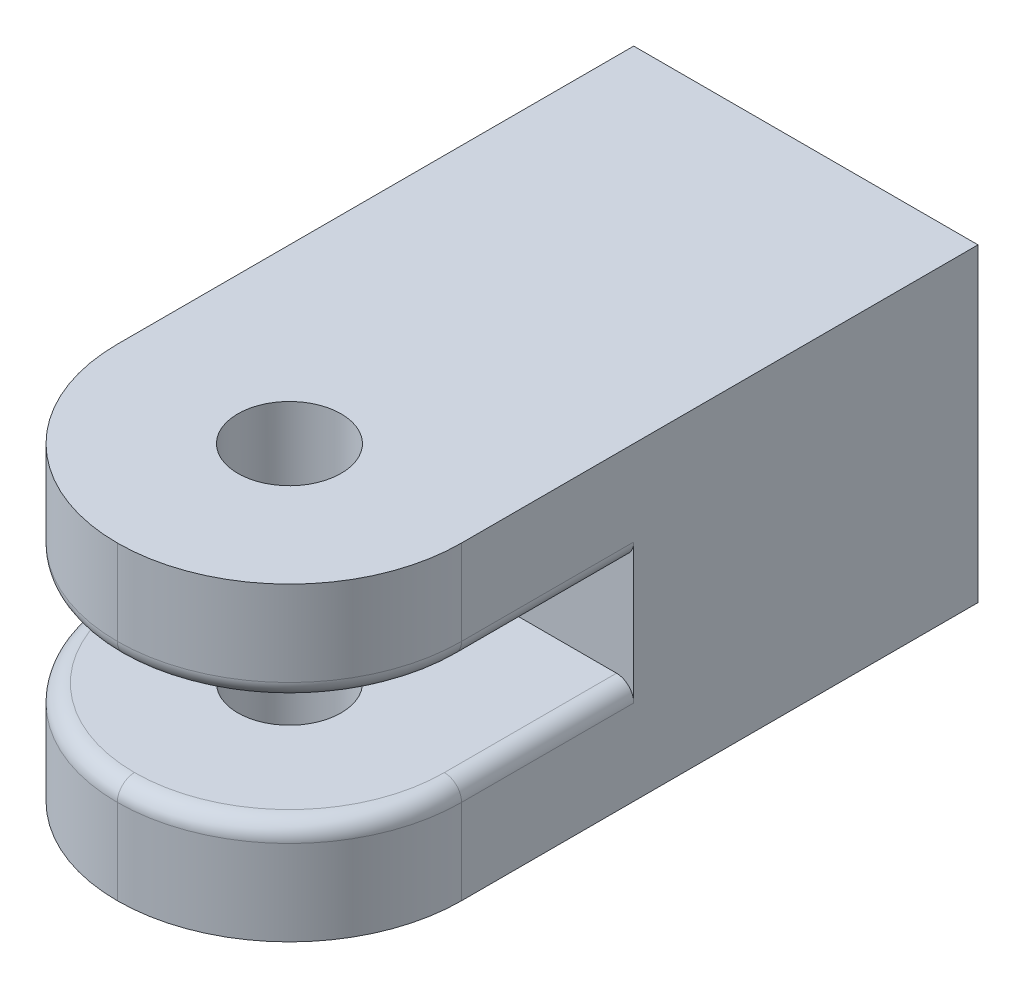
ISO-10303-21;
HEADER;
FILE_DESCRIPTION(('STEP AP214'),'2;1');
FILE_NAME('part.step','',(''),(''),'','','');
FILE_SCHEMA(('AUTOMOTIVE_DESIGN { 1 0 10303 214 1 1 1 1 }'));
ENDSEC;
DATA;
#1=APPLICATION_CONTEXT('core data for automotive mechanical design processes');
#2=APPLICATION_PROTOCOL_DEFINITION('international standard','automotive_design',2000,#1);
#3=PRODUCT_CONTEXT('',#1,'mechanical');
#4=PRODUCT('Part','Part','',(#3));
#5=PRODUCT_RELATED_PRODUCT_CATEGORY('part','',(#4));
#6=PRODUCT_DEFINITION_FORMATION('','',#4);
#7=PRODUCT_DEFINITION_CONTEXT('part definition',#1,'design');
#8=PRODUCT_DEFINITION('design','',#6,#7);
#9=PRODUCT_DEFINITION_SHAPE('','',#8);
#10=(LENGTH_UNIT() NAMED_UNIT(*) SI_UNIT(.MILLI.,.METRE.));
#11=(NAMED_UNIT(*) PLANE_ANGLE_UNIT() SI_UNIT($,.RADIAN.));
#12=(NAMED_UNIT(*) SI_UNIT($,.STERADIAN.) SOLID_ANGLE_UNIT());
#13=UNCERTAINTY_MEASURE_WITH_UNIT(LENGTH_MEASURE(1.E-05),#10,'distance_accuracy_value','');
#14=(GEOMETRIC_REPRESENTATION_CONTEXT(3) GLOBAL_UNCERTAINTY_ASSIGNED_CONTEXT((#13)) GLOBAL_UNIT_ASSIGNED_CONTEXT((#10,
#11,#12)) REPRESENTATION_CONTEXT('',''));
#15=CARTESIAN_POINT('',(0.,0.,0.));
#16=DIRECTION('',(0.,0.,1.));
#17=DIRECTION('',(1.,0.,0.));
#18=AXIS2_PLACEMENT_3D('',#15,#16,#17);
#19=CARTESIAN_POINT('',(0.,0.,20.));
#20=DIRECTION('',(1.,0.,0.));
#21=DIRECTION('',(0.,0.,-1.));
#22=AXIS2_PLACEMENT_3D('',#19,#20,#21);
#23=PLANE('',#22);
#24=DIRECTION('',(0.,-1.,0.));
#25=VECTOR('',#24,1.);
#26=CARTESIAN_POINT('',(0.,2.975,10.));
#27=LINE('',#26,#25);
#28=CARTESIAN_POINT('',(0.,6.525,10.));
#29=VERTEX_POINT('',#28);
#30=CARTESIAN_POINT('',(0.,2.475,10.));
#31=VERTEX_POINT('',#30);
#32=EDGE_CURVE('E185',#29,#31,#27,.T.);
#33=ORIENTED_EDGE('',*,*,#32,.F.);
#34=DIRECTION('',(0.,0.,1.));
#35=VECTOR('',#34,1.);
#36=CARTESIAN_POINT('',(0.,6.525,20.));
#37=LINE('',#36,#35);
#38=CARTESIAN_POINT('',(0.,6.525,15.));
#39=VERTEX_POINT('',#38);
#40=EDGE_CURVE('E242',#29,#39,#37,.T.);
#41=ORIENTED_EDGE('',*,*,#40,.T.);
#42=DIRECTION('',(0.,-1.,0.));
#43=VECTOR('',#42,1.);
#44=CARTESIAN_POINT('',(0.,0.,15.));
#45=LINE('',#44,#43);
#46=CARTESIAN_POINT('',(0.,9.,15.));
#47=VERTEX_POINT('',#46);
#48=EDGE_CURVE('E227',#39,#47,#45,.F.);
#49=ORIENTED_EDGE('',*,*,#48,.T.);
#50=DIRECTION('',(0.,0.,-1.));
#51=VECTOR('',#50,1.);
#52=CARTESIAN_POINT('',(0.,9.,20.));
#53=LINE('',#52,#51);
#54=CARTESIAN_POINT('',(0.,9.,0.));
#55=VERTEX_POINT('',#54);
#56=EDGE_CURVE('E178',#47,#55,#53,.T.);
#57=ORIENTED_EDGE('',*,*,#56,.T.);
#58=DIRECTION('',(0.,-1.,0.));
#59=VECTOR('',#58,1.);
#60=CARTESIAN_POINT('',(0.,0.,0.));
#61=LINE('',#60,#59);
#62=CARTESIAN_POINT('',(0.,0.,0.));
#63=VERTEX_POINT('',#62);
#64=EDGE_CURVE('E172',#55,#63,#61,.T.);
#65=ORIENTED_EDGE('',*,*,#64,.T.);
#66=DIRECTION('',(0.,0.,-1.));
#67=VECTOR('',#66,1.);
#68=CARTESIAN_POINT('',(0.,0.,20.));
#69=LINE('',#68,#67);
#70=CARTESIAN_POINT('',(0.,0.,15.));
#71=VERTEX_POINT('',#70);
#72=EDGE_CURVE('E151',#71,#63,#69,.T.);
#73=ORIENTED_EDGE('',*,*,#72,.F.);
#74=DIRECTION('',(0.,-1.,0.));
#75=VECTOR('',#74,1.);
#76=CARTESIAN_POINT('',(0.,0.,15.));
#77=LINE('',#76,#75);
#78=CARTESIAN_POINT('',(0.,2.475,15.));
#79=VERTEX_POINT('',#78);
#80=EDGE_CURVE('E224',#71,#79,#77,.F.);
#81=ORIENTED_EDGE('',*,*,#80,.T.);
#82=DIRECTION('',(0.,0.,1.));
#83=VECTOR('',#82,1.);
#84=CARTESIAN_POINT('',(0.,2.475,20.));
#85=LINE('',#84,#83);
#86=EDGE_CURVE('E230',#79,#31,#85,.F.);
#87=ORIENTED_EDGE('',*,*,#86,.T.);
#88=EDGE_LOOP('',(#33,#41,#49,#57,#65,#73,#81,#87));
#89=FACE_BOUND('',#88,.T.);
#90=ADVANCED_FACE('F45',(#89),#23,.F.);
#91=CARTESIAN_POINT('',(0.,0.,20.));
#92=DIRECTION('',(0.,1.,0.));
#93=DIRECTION('',(0.,0.,1.));
#94=AXIS2_PLACEMENT_3D('',#91,#92,#93);
#95=PLANE('',#94);
#96=CARTESIAN_POINT('',(5.,0.,15.));
#97=DIRECTION('',(0.,-1.,0.));
#98=DIRECTION('',(0.,0.,-1.));
#99=AXIS2_PLACEMENT_3D('',#96,#97,#98);
#100=CIRCLE('',#99,1.5);
#101=CARTESIAN_POINT('',(5.,0.,13.5));
#102=VERTEX_POINT('',#101);
#103=EDGE_CURVE('E206',#102,#102,#100,.T.);
#104=ORIENTED_EDGE('',*,*,#103,.F.);
#105=EDGE_LOOP('',(#104));
#106=FACE_BOUND('',#105,.T.);
#107=DIRECTION('',(0.,0.,-1.));
#108=VECTOR('',#107,1.);
#109=CARTESIAN_POINT('',(10.,0.,20.));
#110=LINE('',#109,#108);
#111=CARTESIAN_POINT('',(10.,0.,15.));
#112=VERTEX_POINT('',#111);
#113=CARTESIAN_POINT('',(10.,0.,0.));
#114=VERTEX_POINT('',#113);
#115=EDGE_CURVE('E166',#112,#114,#110,.T.);
#116=ORIENTED_EDGE('',*,*,#115,.F.);
#117=CARTESIAN_POINT('',(5.,0.,15.));
#118=DIRECTION('',(0.,1.,0.));
#119=DIRECTION('',(0.,0.,1.));
#120=AXIS2_PLACEMENT_3D('',#117,#118,#119);
#121=CIRCLE('',#120,5.);
#122=CARTESIAN_POINT('',(5.,0.,20.));
#123=VERTEX_POINT('',#122);
#124=EDGE_CURVE('E215',#112,#123,#121,.F.);
#125=ORIENTED_EDGE('',*,*,#124,.T.);
#126=CARTESIAN_POINT('',(5.,0.,15.));
#127=DIRECTION('',(0.,1.,0.));
#128=DIRECTION('',(0.,0.,1.));
#129=AXIS2_PLACEMENT_3D('',#126,#127,#128);
#130=CIRCLE('',#129,5.);
#131=EDGE_CURVE('E159',#123,#71,#130,.F.);
#132=ORIENTED_EDGE('',*,*,#131,.T.);
#133=ORIENTED_EDGE('',*,*,#72,.T.);
#134=DIRECTION('',(1.,0.,0.));
#135=VECTOR('',#134,1.);
#136=CARTESIAN_POINT('',(0.,0.,0.));
#137=LINE('',#136,#135);
#138=EDGE_CURVE('E155',#63,#114,#137,.T.);
#139=ORIENTED_EDGE('',*,*,#138,.T.);
#140=EDGE_LOOP('',(#116,#125,#132,#133,#139));
#141=FACE_BOUND('',#140,.T.);
#142=ADVANCED_FACE('F154',(#106,#141),#95,.F.);
#143=CARTESIAN_POINT('',(10.,0.,20.));
#144=DIRECTION('',(-1.,0.,0.));
#145=DIRECTION('',(0.,0.,1.));
#146=AXIS2_PLACEMENT_3D('',#143,#144,#145);
#147=PLANE('',#146);
#148=DIRECTION('',(0.,1.,0.));
#149=VECTOR('',#148,1.);
#150=CARTESIAN_POINT('',(10.,0.,15.));
#151=LINE('',#150,#149);
#152=CARTESIAN_POINT('',(10.,9.,15.));
#153=VERTEX_POINT('',#152);
#154=CARTESIAN_POINT('',(10.,6.525,15.));
#155=VERTEX_POINT('',#154);
#156=EDGE_CURVE('E165',#153,#155,#151,.F.);
#157=ORIENTED_EDGE('',*,*,#156,.T.);
#158=DIRECTION('',(0.,0.,1.));
#159=VECTOR('',#158,1.);
#160=CARTESIAN_POINT('',(10.,6.525,20.));
#161=LINE('',#160,#159);
#162=CARTESIAN_POINT('',(10.,6.525,10.));
#163=VERTEX_POINT('',#162);
#164=EDGE_CURVE('E286',#155,#163,#161,.F.);
#165=ORIENTED_EDGE('',*,*,#164,.T.);
#166=DIRECTION('',(0.,1.,0.));
#167=VECTOR('',#166,1.);
#168=CARTESIAN_POINT('',(10.,2.975,10.));
#169=LINE('',#168,#167);
#170=CARTESIAN_POINT('',(10.,2.475,10.));
#171=VERTEX_POINT('',#170);
#172=EDGE_CURVE('E62',#171,#163,#169,.T.);
#173=ORIENTED_EDGE('',*,*,#172,.F.);
#174=DIRECTION('',(0.,0.,1.));
#175=VECTOR('',#174,1.);
#176=CARTESIAN_POINT('',(10.,2.475,20.));
#177=LINE('',#176,#175);
#178=CARTESIAN_POINT('',(10.,2.475,15.));
#179=VERTEX_POINT('',#178);
#180=EDGE_CURVE('E283',#171,#179,#177,.T.);
#181=ORIENTED_EDGE('',*,*,#180,.T.);
#182=DIRECTION('',(0.,1.,0.));
#183=VECTOR('',#182,1.);
#184=CARTESIAN_POINT('',(10.,0.,15.));
#185=LINE('',#184,#183);
#186=EDGE_CURVE('E210',#179,#112,#185,.F.);
#187=ORIENTED_EDGE('',*,*,#186,.T.);
#188=ORIENTED_EDGE('',*,*,#115,.T.);
#189=DIRECTION('',(0.,1.,0.));
#190=VECTOR('',#189,1.);
#191=CARTESIAN_POINT('',(10.,0.,0.));
#192=LINE('',#191,#190);
#193=CARTESIAN_POINT('',(10.,9.,0.));
#194=VERTEX_POINT('',#193);
#195=EDGE_CURVE('E174',#114,#194,#192,.T.);
#196=ORIENTED_EDGE('',*,*,#195,.T.);
#197=DIRECTION('',(0.,0.,-1.));
#198=VECTOR('',#197,1.);
#199=CARTESIAN_POINT('',(10.,9.,20.));
#200=LINE('',#199,#198);
#201=EDGE_CURVE('E196',#153,#194,#200,.T.);
#202=ORIENTED_EDGE('',*,*,#201,.F.);
#203=EDGE_LOOP('',(#157,#165,#173,#181,#187,#188,#196,#202));
#204=FACE_BOUND('',#203,.T.);
#205=ADVANCED_FACE('F376',(#204),#147,.F.);
#206=CARTESIAN_POINT('',(0.,9.,20.));
#207=DIRECTION('',(0.,-1.,0.));
#208=DIRECTION('',(0.,0.,-1.));
#209=AXIS2_PLACEMENT_3D('',#206,#207,#208);
#210=PLANE('',#209);
#211=CARTESIAN_POINT('',(5.,9.,15.));
#212=DIRECTION('',(0.,-1.,0.));
#213=DIRECTION('',(0.,0.,-1.));
#214=AXIS2_PLACEMENT_3D('',#211,#212,#213);
#215=CIRCLE('',#214,1.5);
#216=CARTESIAN_POINT('',(5.,9.,13.5));
#217=VERTEX_POINT('',#216);
#218=EDGE_CURVE('E566',#217,#217,#215,.T.);
#219=ORIENTED_EDGE('',*,*,#218,.T.);
#220=EDGE_LOOP('',(#219));
#221=FACE_BOUND('',#220,.T.);
#222=CARTESIAN_POINT('',(5.,9.,15.));
#223=DIRECTION('',(0.,-1.,0.));
#224=DIRECTION('',(0.,0.,-1.));
#225=AXIS2_PLACEMENT_3D('',#222,#223,#224);
#226=CIRCLE('',#225,5.);
#227=CARTESIAN_POINT('',(5.,9.,20.));
#228=VERTEX_POINT('',#227);
#229=EDGE_CURVE('E218',#47,#228,#226,.F.);
#230=ORIENTED_EDGE('',*,*,#229,.T.);
#231=CARTESIAN_POINT('',(5.,9.,15.));
#232=DIRECTION('',(0.,-1.,0.));
#233=DIRECTION('',(0.,0.,-1.));
#234=AXIS2_PLACEMENT_3D('',#231,#232,#233);
#235=CIRCLE('',#234,5.);
#236=EDGE_CURVE('E221',#228,#153,#235,.F.);
#237=ORIENTED_EDGE('',*,*,#236,.T.);
#238=ORIENTED_EDGE('',*,*,#201,.T.);
#239=DIRECTION('',(-1.,0.,0.));
#240=VECTOR('',#239,1.);
#241=CARTESIAN_POINT('',(0.,9.,0.));
#242=LINE('',#241,#240);
#243=EDGE_CURVE('E191',#194,#55,#242,.T.);
#244=ORIENTED_EDGE('',*,*,#243,.T.);
#245=ORIENTED_EDGE('',*,*,#56,.F.);
#246=EDGE_LOOP('',(#230,#237,#238,#244,#245));
#247=FACE_BOUND('',#246,.T.);
#248=ADVANCED_FACE('F379',(#221,#247),#210,.F.);
#249=CARTESIAN_POINT('',(0.,0.,0.));
#250=DIRECTION('',(0.,0.,-1.));
#251=DIRECTION('',(-1.,0.,0.));
#252=AXIS2_PLACEMENT_3D('',#249,#250,#251);
#253=PLANE('',#252);
#254=ORIENTED_EDGE('',*,*,#64,.F.);
#255=ORIENTED_EDGE('',*,*,#243,.F.);
#256=ORIENTED_EDGE('',*,*,#195,.F.);
#257=ORIENTED_EDGE('',*,*,#138,.F.);
#258=EDGE_LOOP('',(#254,#255,#256,#257));
#259=FACE_BOUND('',#258,.T.);
#260=ADVANCED_FACE('F170',(#259),#253,.T.);
#261=CARTESIAN_POINT('',(0.,2.975,10.));
#262=DIRECTION('',(0.,-1.,0.));
#263=DIRECTION('',(1.,0.,0.));
#264=AXIS2_PLACEMENT_3D('',#261,#262,#263);
#265=PLANE('',#264);
#266=CARTESIAN_POINT('',(5.,2.975,15.));
#267=DIRECTION('',(0.,-1.,0.));
#268=DIRECTION('',(1.,0.,0.));
#269=AXIS2_PLACEMENT_3D('',#266,#267,#268);
#270=CIRCLE('',#269,1.5);
#271=CARTESIAN_POINT('',(6.5,2.975,15.));
#272=VERTEX_POINT('',#271);
#273=EDGE_CURVE('E205',#272,#272,#270,.T.);
#274=ORIENTED_EDGE('',*,*,#273,.T.);
#275=EDGE_LOOP('',(#274));
#276=FACE_BOUND('',#275,.T.);
#277=DIRECTION('',(1.,0.,0.));
#278=VECTOR('',#277,1.);
#279=CARTESIAN_POINT('',(0.,2.975,10.));
#280=LINE('',#279,#278);
#281=CARTESIAN_POINT('',(0.5,2.975,10.));
#282=VERTEX_POINT('',#281);
#283=CARTESIAN_POINT('',(9.5,2.975,10.));
#284=VERTEX_POINT('',#283);
#285=EDGE_CURVE('E181',#282,#284,#280,.T.);
#286=ORIENTED_EDGE('',*,*,#285,.F.);
#287=DIRECTION('',(0.,0.,1.));
#288=VECTOR('',#287,1.);
#289=CARTESIAN_POINT('',(0.5,2.975,10.));
#290=LINE('',#289,#288);
#291=CARTESIAN_POINT('',(0.5,2.975,15.));
#292=VERTEX_POINT('',#291);
#293=EDGE_CURVE('E273',#282,#292,#290,.T.);
#294=ORIENTED_EDGE('',*,*,#293,.T.);
#295=CARTESIAN_POINT('',(5.,2.975,15.));
#296=DIRECTION('',(0.,-1.,0.));
#297=DIRECTION('',(1.,0.,0.));
#298=AXIS2_PLACEMENT_3D('',#295,#296,#297);
#299=CIRCLE('',#298,4.5);
#300=CARTESIAN_POINT('',(5.,2.975,19.5));
#301=VERTEX_POINT('',#300);
#302=EDGE_CURVE('E270',#292,#301,#299,.F.);
#303=ORIENTED_EDGE('',*,*,#302,.T.);
#304=CARTESIAN_POINT('',(5.,2.975,15.));
#305=DIRECTION('',(0.,-1.,0.));
#306=DIRECTION('',(1.,0.,0.));
#307=AXIS2_PLACEMENT_3D('',#304,#305,#306);
#308=CIRCLE('',#307,4.5);
#309=CARTESIAN_POINT('',(9.5,2.975,15.));
#310=VERTEX_POINT('',#309);
#311=EDGE_CURVE('E267',#301,#310,#308,.F.);
#312=ORIENTED_EDGE('',*,*,#311,.T.);
#313=DIRECTION('',(0.,0.,1.));
#314=VECTOR('',#313,1.);
#315=CARTESIAN_POINT('',(9.5,2.975,10.));
#316=LINE('',#315,#314);
#317=EDGE_CURVE('E264',#310,#284,#316,.F.);
#318=ORIENTED_EDGE('',*,*,#317,.T.);
#319=EDGE_LOOP('',(#286,#294,#303,#312,#318));
#320=FACE_BOUND('',#319,.T.);
#321=ADVANCED_FACE('F330',(#276,#320),#265,.F.);
#322=CARTESIAN_POINT('',(0.,6.025,10.));
#323=DIRECTION('',(0.,1.,0.));
#324=DIRECTION('',(0.,0.,1.));
#325=AXIS2_PLACEMENT_3D('',#322,#323,#324);
#326=PLANE('',#325);
#327=CARTESIAN_POINT('',(5.,6.025,15.));
#328=DIRECTION('',(0.,1.,0.));
#329=DIRECTION('',(0.,0.,1.));
#330=AXIS2_PLACEMENT_3D('',#327,#328,#329);
#331=CIRCLE('',#330,1.5);
#332=CARTESIAN_POINT('',(5.,6.025,16.5));
#333=VERTEX_POINT('',#332);
#334=EDGE_CURVE('E201',#333,#333,#331,.T.);
#335=ORIENTED_EDGE('',*,*,#334,.T.);
#336=EDGE_LOOP('',(#335));
#337=FACE_BOUND('',#336,.T.);
#338=CARTESIAN_POINT('',(5.,6.025,15.));
#339=DIRECTION('',(0.,1.,0.));
#340=DIRECTION('',(0.,0.,1.));
#341=AXIS2_PLACEMENT_3D('',#338,#339,#340);
#342=CIRCLE('',#341,4.5);
#343=CARTESIAN_POINT('',(5.,6.025,19.5));
#344=VERTEX_POINT('',#343);
#345=CARTESIAN_POINT('',(0.5,6.025,15.));
#346=VERTEX_POINT('',#345);
#347=EDGE_CURVE('E252',#344,#346,#342,.F.);
#348=ORIENTED_EDGE('',*,*,#347,.T.);
#349=DIRECTION('',(0.,0.,1.));
#350=VECTOR('',#349,1.);
#351=CARTESIAN_POINT('',(0.5,6.025,10.));
#352=LINE('',#351,#350);
#353=CARTESIAN_POINT('',(0.5,6.025,10.));
#354=VERTEX_POINT('',#353);
#355=EDGE_CURVE('E255',#346,#354,#352,.F.);
#356=ORIENTED_EDGE('',*,*,#355,.T.);
#357=DIRECTION('',(-1.,0.,0.));
#358=VECTOR('',#357,1.);
#359=CARTESIAN_POINT('',(0.,6.025,10.));
#360=LINE('',#359,#358);
#361=CARTESIAN_POINT('',(9.5,6.025,10.));
#362=VERTEX_POINT('',#361);
#363=EDGE_CURVE('E345',#362,#354,#360,.T.);
#364=ORIENTED_EDGE('',*,*,#363,.F.);
#365=DIRECTION('',(0.,0.,1.));
#366=VECTOR('',#365,1.);
#367=CARTESIAN_POINT('',(9.5,6.025,10.));
#368=LINE('',#367,#366);
#369=CARTESIAN_POINT('',(9.5,6.025,15.));
#370=VERTEX_POINT('',#369);
#371=EDGE_CURVE('E246',#362,#370,#368,.T.);
#372=ORIENTED_EDGE('',*,*,#371,.T.);
#373=CARTESIAN_POINT('',(5.,6.025,15.));
#374=DIRECTION('',(0.,1.,0.));
#375=DIRECTION('',(0.,0.,1.));
#376=AXIS2_PLACEMENT_3D('',#373,#374,#375);
#377=CIRCLE('',#376,4.5);
#378=EDGE_CURVE('E249',#370,#344,#377,.F.);
#379=ORIENTED_EDGE('',*,*,#378,.T.);
#380=EDGE_LOOP('',(#348,#356,#364,#372,#379));
#381=FACE_BOUND('',#380,.T.);
#382=ADVANCED_FACE('F475',(#337,#381),#326,.F.);
#383=CARTESIAN_POINT('',(0.,0.,10.));
#384=DIRECTION('',(0.,0.,-1.));
#385=DIRECTION('',(-1.,0.,0.));
#386=AXIS2_PLACEMENT_3D('',#383,#384,#385);
#387=PLANE('',#386);
#388=ORIENTED_EDGE('',*,*,#172,.T.);
#389=CARTESIAN_POINT('',(9.5,6.525,10.));
#390=DIRECTION('',(0.,0.,-1.));
#391=DIRECTION('',(-1.,0.,0.));
#392=AXIS2_PLACEMENT_3D('',#389,#390,#391);
#393=CIRCLE('',#392,0.5);
#394=EDGE_CURVE('E55',#163,#362,#393,.T.);
#395=ORIENTED_EDGE('',*,*,#394,.T.);
#396=ORIENTED_EDGE('',*,*,#363,.T.);
#397=CARTESIAN_POINT('',(0.5,6.525,10.));
#398=DIRECTION('',(0.,0.,-1.));
#399=DIRECTION('',(-1.,0.,0.));
#400=AXIS2_PLACEMENT_3D('',#397,#398,#399);
#401=CIRCLE('',#400,0.5);
#402=EDGE_CURVE('E289',#354,#29,#401,.T.);
#403=ORIENTED_EDGE('',*,*,#402,.T.);
#404=ORIENTED_EDGE('',*,*,#32,.T.);
#405=CARTESIAN_POINT('',(0.5,2.475,10.));
#406=DIRECTION('',(0.,0.,-1.));
#407=DIRECTION('',(-1.,0.,0.));
#408=AXIS2_PLACEMENT_3D('',#405,#406,#407);
#409=CIRCLE('',#408,0.5);
#410=EDGE_CURVE('E293',#31,#282,#409,.T.);
#411=ORIENTED_EDGE('',*,*,#410,.T.);
#412=ORIENTED_EDGE('',*,*,#285,.T.);
#413=CARTESIAN_POINT('',(9.5,2.475,10.));
#414=DIRECTION('',(0.,0.,-1.));
#415=DIRECTION('',(-1.,0.,0.));
#416=AXIS2_PLACEMENT_3D('',#413,#414,#415);
#417=CIRCLE('',#416,0.5);
#418=EDGE_CURVE('E11',#284,#171,#417,.T.);
#419=ORIENTED_EDGE('',*,*,#418,.T.);
#420=EDGE_LOOP('',(#388,#395,#396,#403,#404,#411,#412,#419));
#421=FACE_BOUND('',#420,.T.);
#422=ADVANCED_FACE('F332',(#421),#387,.F.);
#423=CARTESIAN_POINT('',(5.,10.,15.));
#424=DIRECTION('',(0.,-1.,0.));
#425=DIRECTION('',(0.,0.,-1.));
#426=AXIS2_PLACEMENT_3D('',#423,#424,#425);
#427=CYLINDRICAL_SURFACE('',#426,1.5);
#428=ORIENTED_EDGE('',*,*,#334,.F.);
#429=EDGE_LOOP('',(#428));
#430=FACE_BOUND('',#429,.T.);
#431=ORIENTED_EDGE('',*,*,#218,.F.);
#432=EDGE_LOOP('',(#431));
#433=FACE_BOUND('',#432,.T.);
#434=ADVANCED_FACE('F474',(#430,#433),#427,.F.);
#435=ORIENTED_EDGE('',*,*,#103,.T.);
#436=EDGE_LOOP('',(#435));
#437=FACE_BOUND('',#436,.T.);
#438=ORIENTED_EDGE('',*,*,#273,.F.);
#439=EDGE_LOOP('',(#438));
#440=FACE_BOUND('',#439,.T.);
#441=ADVANCED_FACE('F404',(#437,#440),#427,.F.);
#442=CARTESIAN_POINT('',(5.,0.,15.));
#443=DIRECTION('',(0.,-1.,0.));
#444=DIRECTION('',(0.,0.,-1.));
#445=AXIS2_PLACEMENT_3D('',#442,#443,#444);
#446=CYLINDRICAL_SURFACE('',#445,5.);
#447=DIRECTION('',(0.,-1.,0.));
#448=VECTOR('',#447,1.);
#449=CARTESIAN_POINT('',(5.,0.,20.));
#450=LINE('',#449,#448);
#451=CARTESIAN_POINT('',(5.,2.475,20.));
#452=VERTEX_POINT('',#451);
#453=EDGE_CURVE('E231',#452,#123,#450,.T.);
#454=ORIENTED_EDGE('',*,*,#453,.F.);
#455=CARTESIAN_POINT('',(5.,2.475,15.));
#456=DIRECTION('',(0.,-1.,0.));
#457=DIRECTION('',(1.,0.,0.));
#458=AXIS2_PLACEMENT_3D('',#455,#456,#457);
#459=CIRCLE('',#458,5.);
#460=EDGE_CURVE('E277',#452,#79,#459,.T.);
#461=ORIENTED_EDGE('',*,*,#460,.T.);
#462=ORIENTED_EDGE('',*,*,#80,.F.);
#463=ORIENTED_EDGE('',*,*,#131,.F.);
#464=EDGE_LOOP('',(#454,#461,#462,#463));
#465=FACE_BOUND('',#464,.T.);
#466=ADVANCED_FACE('F341',(#465),#446,.T.);
#467=CARTESIAN_POINT('',(5.,0.,15.));
#468=DIRECTION('',(0.,1.,0.));
#469=DIRECTION('',(0.,0.,1.));
#470=AXIS2_PLACEMENT_3D('',#467,#468,#469);
#471=CYLINDRICAL_SURFACE('',#470,5.);
#472=ORIENTED_EDGE('',*,*,#186,.F.);
#473=CARTESIAN_POINT('',(5.,2.475,15.));
#474=DIRECTION('',(0.,-1.,0.));
#475=DIRECTION('',(1.,0.,0.));
#476=AXIS2_PLACEMENT_3D('',#473,#474,#475);
#477=CIRCLE('',#476,5.);
#478=EDGE_CURVE('E280',#179,#452,#477,.T.);
#479=ORIENTED_EDGE('',*,*,#478,.T.);
#480=ORIENTED_EDGE('',*,*,#453,.T.);
#481=ORIENTED_EDGE('',*,*,#124,.F.);
#482=EDGE_LOOP('',(#472,#479,#480,#481));
#483=FACE_BOUND('',#482,.T.);
#484=ADVANCED_FACE('F398',(#483),#471,.T.);
#485=CARTESIAN_POINT('',(5.,0.,15.));
#486=DIRECTION('',(0.,-1.,0.));
#487=DIRECTION('',(0.,0.,-1.));
#488=AXIS2_PLACEMENT_3D('',#485,#486,#487);
#489=CYLINDRICAL_SURFACE('',#488,5.);
#490=ORIENTED_EDGE('',*,*,#48,.F.);
#491=CARTESIAN_POINT('',(5.,6.525,15.));
#492=DIRECTION('',(0.,1.,0.));
#493=DIRECTION('',(0.,0.,1.));
#494=AXIS2_PLACEMENT_3D('',#491,#492,#493);
#495=CIRCLE('',#494,5.);
#496=CARTESIAN_POINT('',(5.,6.525,20.));
#497=VERTEX_POINT('',#496);
#498=EDGE_CURVE('E258',#39,#497,#495,.T.);
#499=ORIENTED_EDGE('',*,*,#498,.T.);
#500=DIRECTION('',(0.,-1.,0.));
#501=VECTOR('',#500,1.);
#502=CARTESIAN_POINT('',(5.,0.,20.));
#503=LINE('',#502,#501);
#504=EDGE_CURVE('E234',#228,#497,#503,.T.);
#505=ORIENTED_EDGE('',*,*,#504,.F.);
#506=ORIENTED_EDGE('',*,*,#229,.F.);
#507=EDGE_LOOP('',(#490,#499,#505,#506));
#508=FACE_BOUND('',#507,.T.);
#509=ADVANCED_FACE('F360',(#508),#489,.T.);
#510=CARTESIAN_POINT('',(5.,0.,15.));
#511=DIRECTION('',(0.,1.,0.));
#512=DIRECTION('',(0.,0.,1.));
#513=AXIS2_PLACEMENT_3D('',#510,#511,#512);
#514=CYLINDRICAL_SURFACE('',#513,5.);
#515=ORIENTED_EDGE('',*,*,#504,.T.);
#516=CARTESIAN_POINT('',(5.,6.525,15.));
#517=DIRECTION('',(0.,1.,0.));
#518=DIRECTION('',(0.,0.,1.));
#519=AXIS2_PLACEMENT_3D('',#516,#517,#518);
#520=CIRCLE('',#519,5.);
#521=EDGE_CURVE('E261',#497,#155,#520,.T.);
#522=ORIENTED_EDGE('',*,*,#521,.T.);
#523=ORIENTED_EDGE('',*,*,#156,.F.);
#524=ORIENTED_EDGE('',*,*,#236,.F.);
#525=EDGE_LOOP('',(#515,#522,#523,#524));
#526=FACE_BOUND('',#525,.T.);
#527=ADVANCED_FACE('F365',(#526),#514,.T.);
#528=CARTESIAN_POINT('',(9.5,6.525,10.));
#529=DIRECTION('',(0.,0.,1.));
#530=DIRECTION('',(1.,0.,0.));
#531=AXIS2_PLACEMENT_3D('',#528,#529,#530);
#532=CYLINDRICAL_SURFACE('',#531,0.5);
#533=ORIENTED_EDGE('',*,*,#394,.F.);
#534=ORIENTED_EDGE('',*,*,#164,.F.);
#535=CARTESIAN_POINT('',(9.5,6.525,15.));
#536=DIRECTION('',(0.,0.,1.));
#537=DIRECTION('',(1.,0.,0.));
#538=AXIS2_PLACEMENT_3D('',#535,#536,#537);
#539=CIRCLE('',#538,0.5);
#540=EDGE_CURVE('E238',#370,#155,#539,.T.);
#541=ORIENTED_EDGE('',*,*,#540,.F.);
#542=ORIENTED_EDGE('',*,*,#371,.F.);
#543=EDGE_LOOP('',(#533,#534,#541,#542));
#544=FACE_BOUND('',#543,.T.);
#545=ADVANCED_FACE('F375',(#544),#532,.T.);
#546=CARTESIAN_POINT('',(5.,6.525,15.));
#547=DIRECTION('',(0.,1.,0.));
#548=DIRECTION('',(0.,0.,1.));
#549=AXIS2_PLACEMENT_3D('',#546,#547,#548);
#550=TOROIDAL_SURFACE('',#549,4.5,0.5);
#551=ORIENTED_EDGE('',*,*,#540,.T.);
#552=ORIENTED_EDGE('',*,*,#521,.F.);
#553=CARTESIAN_POINT('',(5.,6.525,19.5));
#554=DIRECTION('',(-1.,0.,0.));
#555=DIRECTION('',(0.,0.,1.));
#556=AXIS2_PLACEMENT_3D('',#553,#554,#555);
#557=CIRCLE('',#556,0.5);
#558=EDGE_CURVE('E301',#344,#497,#557,.T.);
#559=ORIENTED_EDGE('',*,*,#558,.F.);
#560=ORIENTED_EDGE('',*,*,#378,.F.);
#561=EDGE_LOOP('',(#551,#552,#559,#560));
#562=FACE_BOUND('',#561,.T.);
#563=ADVANCED_FACE('F368',(#562),#550,.T.);
#564=CARTESIAN_POINT('',(5.,6.525,15.));
#565=DIRECTION('',(0.,1.,0.));
#566=DIRECTION('',(0.,0.,1.));
#567=AXIS2_PLACEMENT_3D('',#564,#565,#566);
#568=TOROIDAL_SURFACE('',#567,4.5,0.5);
#569=ORIENTED_EDGE('',*,*,#558,.T.);
#570=ORIENTED_EDGE('',*,*,#498,.F.);
#571=CARTESIAN_POINT('',(0.5,6.525,15.));
#572=DIRECTION('',(0.,0.,-1.));
#573=DIRECTION('',(-1.,0.,0.));
#574=AXIS2_PLACEMENT_3D('',#571,#572,#573);
#575=CIRCLE('',#574,0.5);
#576=EDGE_CURVE('E298',#346,#39,#575,.T.);
#577=ORIENTED_EDGE('',*,*,#576,.F.);
#578=ORIENTED_EDGE('',*,*,#347,.F.);
#579=EDGE_LOOP('',(#569,#570,#577,#578));
#580=FACE_BOUND('',#579,.T.);
#581=ADVANCED_FACE('F356',(#580),#568,.T.);
#582=CARTESIAN_POINT('',(0.5,6.525,20.));
#583=DIRECTION('',(0.,0.,1.));
#584=DIRECTION('',(1.,0.,0.));
#585=AXIS2_PLACEMENT_3D('',#582,#583,#584);
#586=CYLINDRICAL_SURFACE('',#585,0.5);
#587=ORIENTED_EDGE('',*,*,#402,.F.);
#588=ORIENTED_EDGE('',*,*,#355,.F.);
#589=ORIENTED_EDGE('',*,*,#576,.T.);
#590=ORIENTED_EDGE('',*,*,#40,.F.);
#591=EDGE_LOOP('',(#587,#588,#589,#590));
#592=FACE_BOUND('',#591,.T.);
#593=ADVANCED_FACE('F351',(#592),#586,.T.);
#594=CARTESIAN_POINT('',(9.5,2.475,20.));
#595=DIRECTION('',(0.,0.,1.));
#596=DIRECTION('',(1.,0.,0.));
#597=AXIS2_PLACEMENT_3D('',#594,#595,#596);
#598=CYLINDRICAL_SURFACE('',#597,0.5);
#599=ORIENTED_EDGE('',*,*,#418,.F.);
#600=ORIENTED_EDGE('',*,*,#317,.F.);
#601=CARTESIAN_POINT('',(9.5,2.475,15.));
#602=DIRECTION('',(0.,0.,1.));
#603=DIRECTION('',(1.,0.,0.));
#604=AXIS2_PLACEMENT_3D('',#601,#602,#603);
#605=CIRCLE('',#604,0.5);
#606=EDGE_CURVE('E49',#179,#310,#605,.T.);
#607=ORIENTED_EDGE('',*,*,#606,.F.);
#608=ORIENTED_EDGE('',*,*,#180,.F.);
#609=EDGE_LOOP('',(#599,#600,#607,#608));
#610=FACE_BOUND('',#609,.T.);
#611=ADVANCED_FACE('F47',(#610),#598,.T.);
#612=CARTESIAN_POINT('',(5.,2.475,15.));
#613=DIRECTION('',(0.,-1.,0.));
#614=DIRECTION('',(1.,0.,0.));
#615=AXIS2_PLACEMENT_3D('',#612,#613,#614);
#616=TOROIDAL_SURFACE('',#615,4.5,0.5);
#617=ORIENTED_EDGE('',*,*,#606,.T.);
#618=ORIENTED_EDGE('',*,*,#311,.F.);
#619=CARTESIAN_POINT('',(5.,2.475,19.5));
#620=DIRECTION('',(-1.,0.,0.));
#621=DIRECTION('',(0.,0.,1.));
#622=AXIS2_PLACEMENT_3D('',#619,#620,#621);
#623=CIRCLE('',#622,0.5);
#624=EDGE_CURVE('E310',#452,#301,#623,.T.);
#625=ORIENTED_EDGE('',*,*,#624,.F.);
#626=ORIENTED_EDGE('',*,*,#478,.F.);
#627=EDGE_LOOP('',(#617,#618,#625,#626));
#628=FACE_BOUND('',#627,.T.);
#629=ADVANCED_FACE('F323',(#628),#616,.T.);
#630=CARTESIAN_POINT('',(5.,2.475,15.));
#631=DIRECTION('',(0.,-1.,0.));
#632=DIRECTION('',(1.,0.,0.));
#633=AXIS2_PLACEMENT_3D('',#630,#631,#632);
#634=TOROIDAL_SURFACE('',#633,4.5,0.5);
#635=ORIENTED_EDGE('',*,*,#624,.T.);
#636=ORIENTED_EDGE('',*,*,#302,.F.);
#637=CARTESIAN_POINT('',(0.5,2.475,15.));
#638=DIRECTION('',(0.,0.,-1.));
#639=DIRECTION('',(-1.,0.,0.));
#640=AXIS2_PLACEMENT_3D('',#637,#638,#639);
#641=CIRCLE('',#640,0.5);
#642=EDGE_CURVE('E308',#79,#292,#641,.T.);
#643=ORIENTED_EDGE('',*,*,#642,.F.);
#644=ORIENTED_EDGE('',*,*,#460,.F.);
#645=EDGE_LOOP('',(#635,#636,#643,#644));
#646=FACE_BOUND('',#645,.T.);
#647=ADVANCED_FACE('F338',(#646),#634,.T.);
#648=CARTESIAN_POINT('',(0.5,2.475,10.));
#649=DIRECTION('',(0.,0.,1.));
#650=DIRECTION('',(1.,0.,0.));
#651=AXIS2_PLACEMENT_3D('',#648,#649,#650);
#652=CYLINDRICAL_SURFACE('',#651,0.5);
#653=ORIENTED_EDGE('',*,*,#410,.F.);
#654=ORIENTED_EDGE('',*,*,#86,.F.);
#655=ORIENTED_EDGE('',*,*,#642,.T.);
#656=ORIENTED_EDGE('',*,*,#293,.F.);
#657=EDGE_LOOP('',(#653,#654,#655,#656));
#658=FACE_BOUND('',#657,.T.);
#659=ADVANCED_FACE('F336',(#658),#652,.T.);
#660=CLOSED_SHELL('',(#90,#142,#205,#248,#260,#321,#382,#422,#434,#441,#466,#484,#509,#527,#545,
#563,#581,#593,#611,#629,#647,#659));
#661=MANIFOLD_SOLID_BREP('B2',#660);
#662=ADVANCED_BREP_SHAPE_REPRESENTATION('',(#18,#661),#14);
#663=SHAPE_DEFINITION_REPRESENTATION(#9,#662);
ENDSEC;
END-ISO-10303-21;
